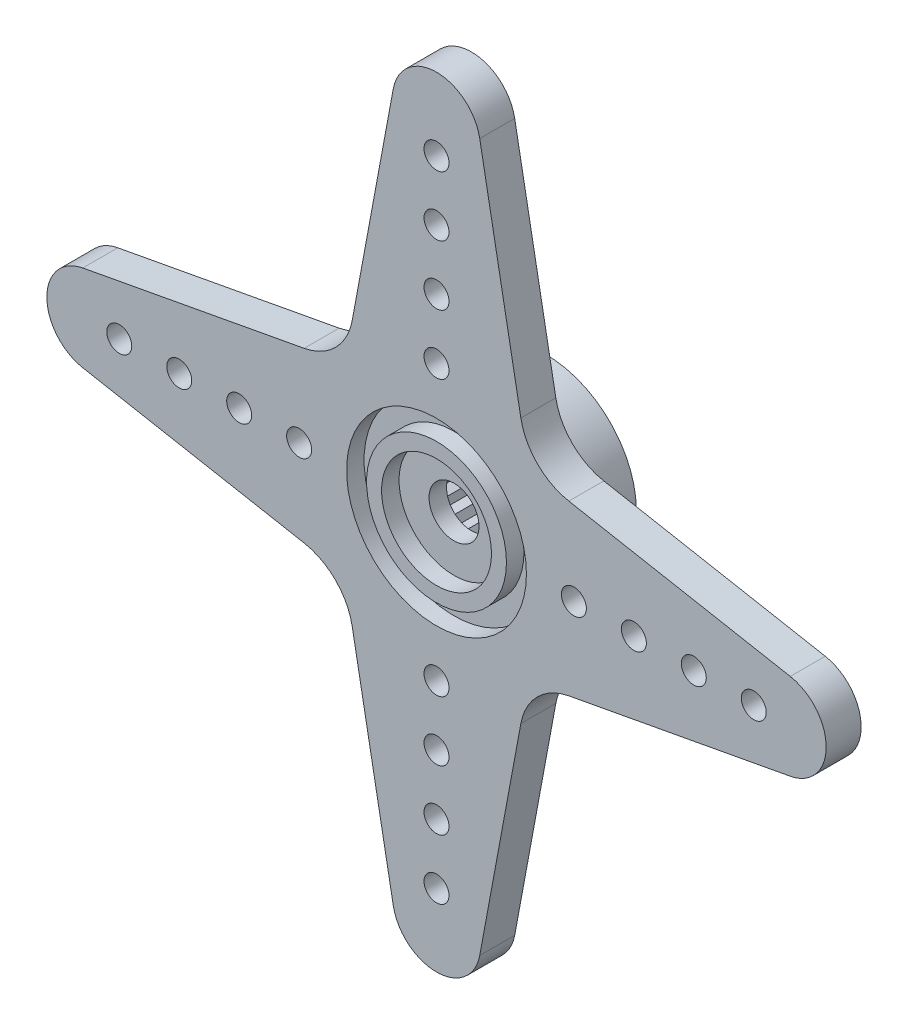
from build123d import *

# Parameters (mm, degrees)
SKETCH1_R           = 4.5000037
BOSS_EXTRUDE1_DEPTH = 3.75000012
BOSS_EXTRUDE2_START = 1.750000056
SKETCH2_R           = 4.5000037
SKETCH2_R_2         = 3.499999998
SKETCH2_R_3         = 1.25000004
BOSS_EXTRUDE2_DEPTH = 1.750000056
SKETCH4_R           = 2.75000466
SKETCH4_R_2         = 1.25000004
CUT_EXTRUDE1_DEPTH  = 0.875000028
SKETCH6_R           = 4.5000037
SKETCH6_R_2         = 3.5000057
CUT_EXTRUDE2_DEPTH  = 0.875000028
SKETCH10_R          = 0.62500002
SKETCH10_R_2        = 4.5000037
BOSS_EXTRUDE4_DEPTH = 1.750000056
CHAMFER2_SIZE       = 1.00000054
CHAMFER2_SIZE2      = 0.577350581


with BuildPart() as part:
    # Sketch1 → Boss-Extrude1 (new body)
    with BuildSketch(Plane.XY):
        with Locations((-10.24995918, 0)):
            Circle(SKETCH1_R)
        Polygon((-10.24995918, 2.999994), (-10.594624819, 2.728309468), (-10.996027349, 2.905743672), (-11.262299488, 2.55687975), (-11.695217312, 2.628914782), (-11.866365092, 2.224791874), (-12.303596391, 2.186901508), (-12.368865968, 1.752912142), (-12.782937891, 1.60747717), (-12.738228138, 1.170890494), (-13.103123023, 0.927049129), (-12.951243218, 0.515297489), (-13.244033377, 0.188371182), (-12.994526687, -0.172673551), (-13.196815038, -0.562142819), (-12.865358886, -0.849794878), (-12.964434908, -1.27733532), (-12.571855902, -1.473520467), (-12.561494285, -1.912268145), (-12.132459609, -2.004659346), (-12.01331141, -2.427046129), (-11.574778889, -2.409838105), (-11.354330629, -2.789323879), (-10.933854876, -2.663597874), (-10.625958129, -2.976338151), (-10.24995918, -2.749993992), (-9.873960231, -2.976338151), (-9.566063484, -2.663597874), (-9.145587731, -2.789323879), (-8.925139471, -2.409838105), (-8.48660695, -2.427046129), (-8.367458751, -2.004659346), (-7.938424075, -1.912268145), (-7.928062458, -1.473520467), (-7.535483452, -1.27733532), (-7.634559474, -0.849794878), (-7.303103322, -0.562142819), (-7.505391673, -0.172673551), (-7.255884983, 0.188371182), (-7.548675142, 0.515297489), (-7.396795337, 0.927049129), (-7.761690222, 1.170890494), (-7.716980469, 1.60747717), (-8.131052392, 1.752912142), (-8.196321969, 2.186901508), (-8.633553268, 2.224791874), (-8.804701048, 2.628914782), (-9.237618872, 2.55687975), (-9.503891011, 2.905743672), (-9.905293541, 2.728309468), align=None, mode=Mode.SUBTRACT)
    extrude(amount=-BOSS_EXTRUDE1_DEPTH)

    # Sketch2 → Boss-Extrude2 (add)
    # profile 1 of 2: a face of its own
    with BuildSketch(Plane.XY.offset(BOSS_EXTRUDE2_START)):
        with Locations((-10.24995918, 0)):
            Circle(SKETCH2_R)
        with Locations((-10.24995918, 0)):
            Circle(SKETCH2_R_2, mode=Mode.SUBTRACT)
    # profile 2 of 2: a face of its own
    with BuildSketch(Plane.XY.offset(BOSS_EXTRUDE2_START)):
        with Locations((-10.24995918, 0)):
            Circle(SKETCH2_R_2)
        with Locations((-10.24995918, 0)):
            Circle(SKETCH2_R_3, mode=Mode.SUBTRACT)
    extrude(amount=-BOSS_EXTRUDE2_DEPTH)

    # Sketch4 → Cut-Extrude1 (cut)
    with BuildSketch(Plane.XY.offset(1.750000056)):
        with Locations((-10.24995918, 0)):
            Circle(SKETCH4_R)
        with Locations((-10.24995918, 0)):
            Circle(SKETCH4_R_2, mode=Mode.SUBTRACT)
    extrude(amount=-CUT_EXTRUDE1_DEPTH, mode=Mode.SUBTRACT)

    # Sketch6 → Cut-Extrude2 (cut)
    with BuildSketch(Plane.XY.offset(1.750000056)):
        with Locations((-10.24995918, 0)):
            Circle(SKETCH6_R)
        with Locations((-10.24995918, 0)):
            Circle(SKETCH6_R_2, mode=Mode.SUBTRACT)
    extrude(amount=-CUT_EXTRUDE2_DEPTH, mode=Mode.SUBTRACT)

    # Sketch10 → Boss-Extrude4 (add)
    with BuildSketch(Plane.XY.offset(1.750000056)):
        with BuildLine():
            Line((-8.086927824, 17.701557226), (-6.029886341, 6.622035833))
            ThreePointArc((-6.029886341, 6.622035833), (-5.20161423, 5.04834495), (-3.627923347, 4.220072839))
            Line((-3.627923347, 4.220072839), (7.451598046, 2.163031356))
            ThreePointArc((7.451598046, 2.163031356), (9.25000182, 0), (7.451598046, -2.163031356))
            Line((7.451598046, -2.163031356), (-3.627923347, -4.220072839))
            ThreePointArc((-3.627923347, -4.220072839), (-5.20161423, -5.04834495), (-6.029886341, -6.622035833))
            Line((-6.029886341, -6.622035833), (-8.086927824, -17.701557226))
            ThreePointArc((-8.086927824, -17.701557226), (-10.24995918, -19.499961), (-12.412990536, -17.701557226))
            Line((-12.412990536, -17.701557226), (-14.470032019, -6.622035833))
            ThreePointArc((-14.470032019, -6.622035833), (-15.29830413, -5.04834495), (-16.871995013, -4.220072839))
            Line((-16.871995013, -4.220072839), (-27.951516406, -2.163031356))
            ThreePointArc((-27.951516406, -2.163031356), (-29.74992018, 0), (-27.951516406, 2.163031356))
            Line((-27.951516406, 2.163031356), (-16.871995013, 4.220072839))
            ThreePointArc((-16.871995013, 4.220072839), (-15.29830413, 5.04834495), (-14.470032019, 6.622035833))
            Line((-14.470032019, 6.622035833), (-12.412990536, 17.701557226))
            ThreePointArc((-12.412990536, 17.701557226), (-10.24995918, 19.499961), (-8.086927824, 17.701557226))
        make_face()
        with Locations((-10.24995918, 15.87496698)):
            Circle(SKETCH10_R, mode=Mode.SUBTRACT)
        with Locations((-10.24995918, 12.87497298)):
            Circle(SKETCH10_R, mode=Mode.SUBTRACT)
        with Locations((-10.24995918, 9.87497898)):
            Circle(SKETCH10_R, mode=Mode.SUBTRACT)
        with Locations((-10.24995918, 6.87498498)):
            Circle(SKETCH10_R, mode=Mode.SUBTRACT)
        with Locations((5.6250078, 0)):
            Circle(SKETCH10_R, mode=Mode.SUBTRACT)
        with Locations((2.6250138, 0)):
            Circle(SKETCH10_R, mode=Mode.SUBTRACT)
        with Locations((-0.3749802, 0)):
            Circle(SKETCH10_R, mode=Mode.SUBTRACT)
        with Locations((-3.3749742, 0)):
            Circle(SKETCH10_R, mode=Mode.SUBTRACT)
        with Locations((-10.24995918, -15.87496698)):
            Circle(SKETCH10_R, mode=Mode.SUBTRACT)
        with Locations((-10.24995918, -12.87497298)):
            Circle(SKETCH10_R, mode=Mode.SUBTRACT)
        with Locations((-10.24995918, -9.87497898)):
            Circle(SKETCH10_R, mode=Mode.SUBTRACT)
        with Locations((-10.24995918, -6.87498498)):
            Circle(SKETCH10_R, mode=Mode.SUBTRACT)
        with Locations((-26.12492616, 0)):
            Circle(SKETCH10_R, mode=Mode.SUBTRACT)
        with Locations((-23.12493216, 0)):
            Circle(SKETCH10_R, mode=Mode.SUBTRACT)
        with Locations((-20.12493816, 0)):
            Circle(SKETCH10_R, mode=Mode.SUBTRACT)
        with Locations((-17.12494416, 0)):
            Circle(SKETCH10_R, mode=Mode.SUBTRACT)
        with Locations((-10.24995918, 0)):
            Circle(SKETCH10_R_2, mode=Mode.SUBTRACT)
    extrude(amount=-BOSS_EXTRUDE4_DEPTH)

    # Chamfer2
    chamfer2_edges = [part.edges().sort_by_distance(p)[0] for p in [
        (-14.74996288, 0, 0),
    ]]
    chamfer2_side = [part.faces().sort_by_distance(p)[0] for p in [
        (-14.74996288, 0, -1.87500006),
    ]]
    chamfer(chamfer2_edges, length=CHAMFER2_SIZE, length2=CHAMFER2_SIZE2, reference=chamfer2_side[0])


solid = part.part
